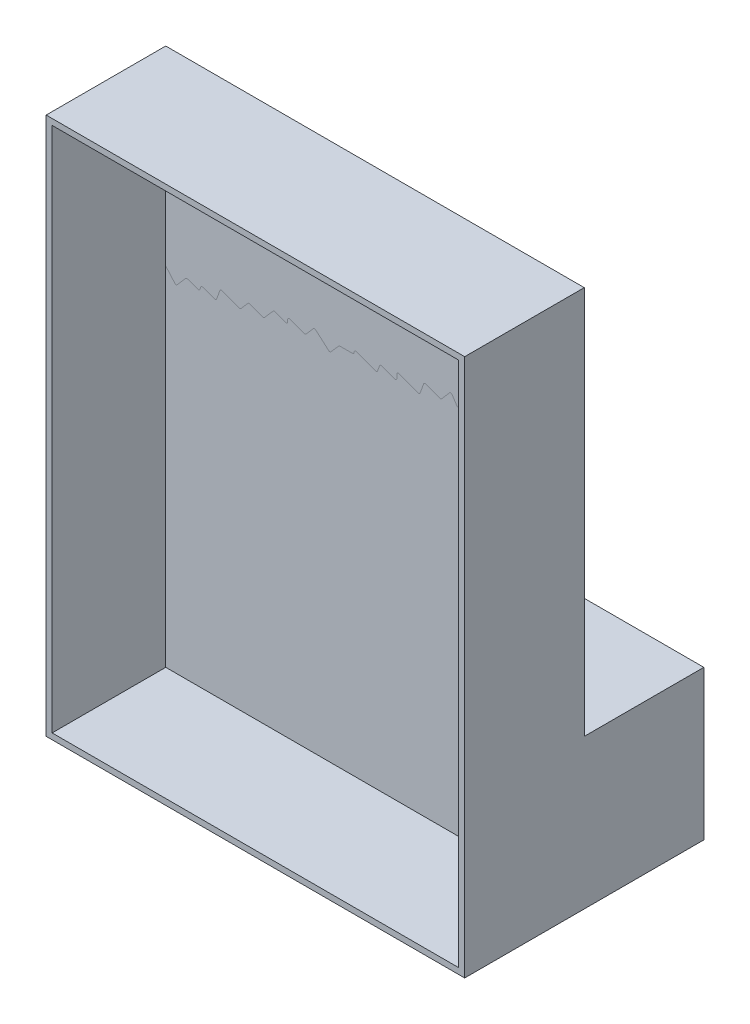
from build123d import *

# Parameters (mm, degrees)
ESQUISSE1_W             = 1400
ESQUISSE1_H             = 1800
BOSS_EXTRU_1_DEPTH      = 200
COQUE1_T                = -20
ESQUISSE2_W             = 1400
ESQUISSE2_H             = 500
BOSS_EXTRU_2_DEPTH      = 400
ESQUISSE3_W             = 270
ESQUISSE3_H             = 300
ENL_V_MAT_EXTRU_1_DEPTH = 400
ENL_V_MAT_EXTRU_2_REACH = 1210.305
BOSS_EXTRU_3_DEPTH      = 20


with BuildPart() as part:
    # Esquisse1 → Boss.-Extru.1 (new, symmetric)
    with BuildSketch(Plane.XY):
        Rectangle(ESQUISSE1_W, ESQUISSE1_H)
    extrude(amount=BOSS_EXTRU_1_DEPTH, both=True)

    # Coque1
    coque1_openings = [part.faces().sort_by_distance(p)[0] for p in [
        (0, 0, 200),
    ]]
    offset(amount=COQUE1_T, openings=coque1_openings, kind=Kind.INTERSECTION)

    # Esquisse2 → Boss.-Extru.2 (add)
    with BuildSketch(Plane(origin=(0, 0, -200), x_dir=(-1, 0, 0), z_dir=(0, 0, -1))):
        with Locations((0, -650)):
            Rectangle(ESQUISSE2_W, ESQUISSE2_H)
    extrude(amount=BOSS_EXTRU_2_DEPTH)

    # Esquisse3 → Enl_v. mat.-Extru.1 (cut)
    with BuildSketch(Plane(origin=(0, 0, -600), x_dir=(-1, 0, 0), z_dir=(0, 0, -1))):
        with Locations((-501, -650)):
            Rectangle(ESQUISSE3_W, ESQUISSE3_H)
        with Locations((-167, -650)):
            Rectangle(ESQUISSE3_W, ESQUISSE3_H)
        with Locations((167, -650)):
            Rectangle(ESQUISSE3_W, ESQUISSE3_H)
        with Locations((501, -650)):
            Rectangle(ESQUISSE3_W, ESQUISSE3_H)
    extrude(amount=-ENL_V_MAT_EXTRU_1_DEPTH, mode=Mode.SUBTRACT)

    # Esquisse4 → Enl_v. mat.-Extru.2 (cut, up to next)
    with BuildSketch(Plane(origin=(0, 0, -200), x_dir=(-1, 0, 0), z_dir=(0, 0, -1)), mode=Mode.PRIVATE) as enl_v_mat_extru_2_sk1:
        with BuildLine():
            Line((-680, 745.327259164), (-680, 426.37321948))
            Line((-680, 426.37321948), (-630.01055563, 426.37321948))
            ThreePointArc((-630.01055563, 426.37321948), (-628.585727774, 426.165908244), (-627.279053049, 425.561165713))
            Line((-627.279053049, 425.561165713), (-585.066427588, 398.028841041))
            ThreePointArc((-585.066427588, 398.028841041), (-581.982993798, 397.22918821), (-579.042401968, 398.453903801))
            Line((-579.042401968, 398.453903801), (-546.48647738, 426.940337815))
            ThreePointArc((-546.48647738, 426.940337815), (-542.861359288, 428.166380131), (-539.431070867, 426.469977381))
            Line((-539.431070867, 426.469977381), (-515.020264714, 398.571913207))
            ThreePointArc((-515.020264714, 398.571913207), (-513.323462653, 397.311271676), (-511.257381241, 396.864436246))
            Line((-511.257381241, 396.864436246), (-463.83513223, 396.864436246))
            ThreePointArc((-463.83513223, 396.864436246), (-461.769050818, 396.417600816), (-460.072248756, 395.156959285))
            Line((-460.072248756, 395.156959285), (-435.265251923, 366.806105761))
            ThreePointArc((-435.265251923, 366.806105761), (-431.834963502, 365.109703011), (-428.20984541, 366.335745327))
            Line((-428.20984541, 366.335745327), (-377.347209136, 410.840552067))
            ThreePointArc((-377.347209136, 410.840552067), (-372.802144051, 411.918240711), (-369.350249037, 408.771265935))
            Line((-369.350249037, 408.771265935), (-354.078458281, 366.349624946))
            ThreePointArc((-354.078458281, 366.349624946), (-352.249087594, 363.952501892), (-349.374021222, 363.043222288))
            Line((-349.374021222, 363.043222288), (-297.493125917, 363.043222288))
            ThreePointArc((-297.493125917, 363.043222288), (-295.111688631, 363.646774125), (-293.305179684, 365.311719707))
            Line((-293.305179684, 365.311719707), (-277.53770531, 389.486448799))
            ThreePointArc((-277.53770531, 389.486448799), (-273.701690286, 391.742545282), (-269.586875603, 390.047469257))
            Line((-269.586875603, 390.047469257), (-242.847964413, 359.48871361))
            ThreePointArc((-242.847964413, 359.48871361), (-240.337622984, 357.940664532), (-237.391483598, 358.07679959))
            Line((-237.391483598, 358.07679959), (-189.040093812, 375.483299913))
            ThreePointArc((-189.040093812, 375.483299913), (-185.217511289, 375.302956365), (-182.642059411, 372.472460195))
            Line((-182.642059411, 372.472460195), (-171.123934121, 340.477667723))
            ThreePointArc((-171.123934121, 340.477667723), (-168.548482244, 337.647171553), (-164.725899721, 337.466828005))
            Line((-164.725899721, 337.466828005), (-99.748076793, 360.858844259))
            ThreePointArc((-99.748076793, 360.858844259), (-95.179413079, 360.245127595), (-93.054479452, 356.154407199))
            Line((-93.054479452, 356.154407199), (-93.054479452, 342.887362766))
            ThreePointArc((-93.054479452, 342.887362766), (-90.929545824, 338.79664237), (-86.36088211, 338.182925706))
            Line((-86.36088211, 338.182925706), (-41.576625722, 354.305258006))
            ThreePointArc((-41.576625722, 354.305258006), (-37.754043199, 354.124914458), (-35.178591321, 351.294418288))
            Line((-35.178591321, 351.294418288), (-28.506322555, 332.760338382))
            ThreePointArc((-28.506322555, 332.760338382), (-25.930870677, 329.929842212), (-22.108288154, 329.749498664))
            Line((-22.108288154, 329.749498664), (43.117230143, 353.230685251))
            ThreePointArc((43.117230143, 353.230685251), (47.685893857, 352.616968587), (49.810827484, 348.526248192))
            Line((49.810827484, 348.526248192), (49.810827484, 346.848140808))
            ThreePointArc((49.810827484, 346.848140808), (51.275293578, 343.312606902), (54.810827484, 341.848140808))
            Line((54.810827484, 341.848140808), (97.570805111, 341.848140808))
            ThreePointArc((97.570805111, 341.848140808), (99.636886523, 341.401305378), (101.333688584, 340.140663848))
            Line((101.333688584, 340.140663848), (127.401577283, 310.348791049))
            ThreePointArc((127.401577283, 310.348791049), (130.831865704, 308.652388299), (134.456983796, 309.878430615))
            Line((134.456983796, 309.878430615), (178.898427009, 348.764693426))
            ThreePointArc((178.898427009, 348.764693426), (182.523545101, 349.990735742), (185.953833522, 348.294332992))
            Line((185.953833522, 348.294332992), (210.568125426, 320.163713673))
            ThreePointArc((210.568125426, 320.163713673), (213.078466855, 318.615664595), (216.024606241, 318.751799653))
            Line((216.024606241, 318.751799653), (265.430491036, 336.537918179))
            ThreePointArc((265.430491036, 336.537918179), (269.99915475, 335.924201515), (272.124088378, 331.83348112))
            Line((272.124088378, 331.83348112), (272.124088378, 324.710357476))
            ThreePointArc((272.124088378, 324.710357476), (274.249022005, 320.61963708), (278.817685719, 320.005920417))
            Line((278.817685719, 320.005920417), (315.224227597, 333.112275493))
            ThreePointArc((315.224227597, 333.112275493), (318.170366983, 333.248410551), (320.680708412, 331.700361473))
            Line((320.680708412, 331.700361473), (349.540055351, 298.718250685))
            ThreePointArc((349.540055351, 298.718250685), (352.05039678, 297.170201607), (354.996536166, 297.306336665))
            Line((354.996536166, 297.306336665), (399.594376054, 313.361559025))
            ThreePointArc((399.594376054, 313.361559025), (402.540515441, 313.497694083), (405.050856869, 311.949645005))
            Line((405.050856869, 311.949645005), (428.235335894, 285.453097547))
            ThreePointArc((428.235335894, 285.453097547), (430.745677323, 283.905048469), (433.691816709, 284.041183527))
            Line((433.691816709, 284.041183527), (492.503644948, 305.213441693))
            ThreePointArc((492.503644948, 305.213441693), (496.326227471, 305.033098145), (498.901679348, 302.202601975))
            Line((498.901679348, 302.202601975), (509.827467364, 271.85319082))
            ThreePointArc((509.827467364, 271.85319082), (512.402919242, 269.02269465), (516.225501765, 268.842351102))
            Line((516.225501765, 268.842351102), (556.454621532, 283.324834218))
            ThreePointArc((556.454621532, 283.324834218), (560.277204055, 283.144490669), (562.852655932, 280.3139945))
            Line((562.852655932, 280.3139945), (565.898545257, 271.85319082))
            ThreePointArc((565.898545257, 271.85319082), (568.473997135, 269.02269465), (572.296579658, 268.842351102))
            Line((572.296579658, 268.842351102), (607.694597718, 281.585637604))
            ThreePointArc((607.694597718, 281.585637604), (610.640737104, 281.721772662), (613.151078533, 280.173723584))
            Line((613.151078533, 280.173723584), (641.688930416, 247.559035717))
            ThreePointArc((641.688930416, 247.559035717), (645.4521097, 245.851558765), (649.215086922, 247.559480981))
            Line((649.215086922, 247.559480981), (680, 282.750640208))
            Line((680, 282.750640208), (680, 512.173721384))
            Line((680, 512.173721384), (613.762081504, 523.796983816))
            ThreePointArc((613.762081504, 523.796983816), (611.407184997, 524.89583432), (609.921827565, 527.02813901))
            Line((609.921827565, 527.02813901), (606.89078242, 535.447708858))
            ThreePointArc((606.89078242, 535.447708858), (604.315330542, 538.278205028), (600.492748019, 538.458548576))
            Line((600.492748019, 538.458548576), (562.845127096, 524.905405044))
            ThreePointArc((562.845127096, 524.905405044), (561.15861715, 524.609847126), (559.471276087, 524.900622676))
            Line((559.471276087, 524.900622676), (520.045828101, 538.967657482))
            ThreePointArc((520.045828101, 538.967657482), (517.639440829, 540.796014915), (516.726081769, 543.676876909))
            Line((516.726081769, 543.676876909), (516.726081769, 554.175823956))
            ThreePointArc((516.726081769, 554.175823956), (515.261615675, 557.711357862), (511.726081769, 559.175823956))
            Line((511.726081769, 559.175823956), (450.187606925, 559.175823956))
            ThreePointArc((450.187606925, 559.175823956), (448.121525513, 559.622659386), (446.424723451, 560.883300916))
            Line((446.424723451, 560.883300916), (432.728440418, 576.536195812))
            ThreePointArc((432.728440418, 576.536195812), (430.218098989, 578.08424489), (427.271959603, 577.948109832))
            Line((427.271959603, 577.948109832), (378.336649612, 560.331398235))
            ThreePointArc((378.336649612, 560.331398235), (375.390510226, 560.195263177), (372.880168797, 561.743312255))
            Line((372.880168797, 561.743312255), (355.079130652, 582.087355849))
            ThreePointArc((355.079130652, 582.087355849), (351.648842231, 583.783758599), (348.023724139, 582.557716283))
            Line((348.023724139, 582.557716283), (322.197039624, 559.959367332))
            ThreePointArc((322.197039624, 559.959367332), (318.571921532, 558.733325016), (315.141633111, 560.429727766))
            Line((315.141633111, 560.429727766), (294.39272784, 584.142762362))
            ThreePointArc((294.39272784, 584.142762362), (292.695925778, 585.403403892), (290.629844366, 585.850239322))
            Line((290.629844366, 585.850239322), (253.618332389, 585.850239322))
            ThreePointArc((253.618332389, 585.850239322), (251.552250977, 586.297074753), (249.855448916, 587.557716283))
            Line((249.855448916, 587.557716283), (216.341424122, 625.859458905))
            ThreePointArc((216.341424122, 625.859458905), (212.226609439, 627.554534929), (208.390594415, 625.298438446))
            Line((208.390594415, 625.298438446), (186.266493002, 591.377713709))
            ThreePointArc((186.266493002, 591.377713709), (182.430477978, 589.121617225), (178.315663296, 590.81669325))
            Line((178.315663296, 590.81669325), (145.554148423, 628.258424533))
            ThreePointArc((145.554148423, 628.258424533), (143.043806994, 629.806473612), (140.097667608, 629.670338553))
            Line((140.097667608, 629.670338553), (89.157543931, 611.33189403))
            ThreePointArc((89.157543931, 611.33189403), (86.211404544, 611.195758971), (83.701063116, 612.74380805))
            Line((83.701063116, 612.74380805), (52.057379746, 648.908017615))
            ThreePointArc((52.057379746, 648.908017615), (49.547038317, 650.456066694), (46.600898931, 650.319931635))
            Line((46.600898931, 650.319931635), (-23.60279666, 625.046601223))
            ThreePointArc((-23.60279666, 625.046601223), (-26.548936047, 624.910466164), (-29.059277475, 626.458515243))
            Line((-29.059277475, 626.458515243), (-44.68509985, 644.316597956))
            ThreePointArc((-44.68509985, 644.316597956), (-47.195441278, 645.864647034), (-50.141580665, 645.728511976))
            Line((-50.141580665, 645.728511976), (-89.844550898, 631.435442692))
            ThreePointArc((-89.844550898, 631.435442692), (-92.790690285, 631.299307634), (-95.301031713, 632.847356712))
            Line((-95.301031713, 632.847356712), (-119.865308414, 660.920815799))
            ThreePointArc((-119.865308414, 660.920815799), (-122.375649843, 662.468864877), (-125.321789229, 662.332729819))
            Line((-125.321789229, 662.332729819), (-166.220408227, 647.609226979))
            ThreePointArc((-166.220408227, 647.609226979), (-169.166547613, 647.473091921), (-171.676889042, 649.021140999))
            Line((-171.676889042, 649.021140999), (-195.948453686, 676.760072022))
            ThreePointArc((-195.948453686, 676.760072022), (-199.378742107, 678.456474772), (-203.003860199, 677.230432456))
            Line((-203.003860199, 677.230432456), (-224.359656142, 658.544111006))
            ThreePointArc((-224.359656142, 658.544111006), (-227.984774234, 657.31806869), (-231.415062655, 659.01447144))
            Line((-231.415062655, 659.01447144), (-249.787761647, 680.011841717))
            ThreePointArc((-249.787761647, 680.011841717), (-253.218050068, 681.708244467), (-256.84316816, 680.482202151))
            Line((-256.84316816, 680.482202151), (-291.021877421, 650.575831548))
            ThreePointArc((-291.021877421, 650.575831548), (-294.646995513, 649.349789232), (-298.077283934, 651.046191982))
            Line((-298.077283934, 651.046191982), (-310.256148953, 664.964894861))
            ThreePointArc((-310.256148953, 664.964894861), (-312.766490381, 666.512943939), (-315.712629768, 666.376808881))
            Line((-315.712629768, 666.376808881), (-354.410389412, 652.445615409))
            ThreePointArc((-354.410389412, 652.445615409), (-357.356528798, 652.309480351), (-359.866870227, 653.857529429))
            Line((-359.866870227, 653.857529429), (-385.187464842, 682.795351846))
            ThreePointArc((-385.187464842, 682.795351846), (-386.138108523, 683.636992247), (-387.270094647, 684.212048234))
            Line((-387.270094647, 684.212048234), (-446.01203563, 705.171224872))
            ThreePointArc((-446.01203563, 705.171224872), (-448.627030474, 705.373854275), (-450.984812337, 704.224888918))
            Line((-450.984812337, 704.224888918), (-470.593544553, 687.06724823))
            ThreePointArc((-470.593544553, 687.06724823), (-474.218662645, 685.841205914), (-477.648951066, 687.537608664))
            Line((-477.648951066, 687.537608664), (-509.180575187, 723.573750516))
            ThreePointArc((-509.180575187, 723.573750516), (-513.29538987, 725.268826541), (-517.131404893, 723.012730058))
            Line((-517.131404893, 723.012730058), (-539.118411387, 689.302199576))
            ThreePointArc((-539.118411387, 689.302199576), (-542.95442641, 687.046103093), (-547.069241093, 688.741179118))
            Line((-547.069241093, 688.741179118), (-579.646835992, 725.972716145))
            ThreePointArc((-579.646835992, 725.972716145), (-582.15717742, 727.520765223), (-585.103316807, 727.384630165))
            Line((-585.103316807, 727.384630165), (-626.183035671, 712.595931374))
            ThreePointArc((-626.183035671, 712.595931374), (-628.456290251, 712.334082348), (-630.608135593, 713.1124222))
            Line((-630.608135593, 713.1124222), (-680, 745.327259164))
        make_face()
    enl_v_mat_extru_2_tool1 = extrude(enl_v_mat_extru_2_sk1.sketch, amount=-ENL_V_MAT_EXTRU_2_REACH, mode=Mode.PRIVATE) & part.part
    add(enl_v_mat_extru_2_tool1.solids().sort_by_distance((22.367634, 489.100637, -200))[0], mode=Mode.SUBTRACT)


with BuildPart() as body_2:
    # Esquisse4_2 → Boss.-Extru.3 (new body)
    with BuildSketch(Plane(origin=(0, 0, -200), x_dir=(-1, 0, 0), z_dir=(0, 0, -1))):
        with BuildLine():
            Line((-680, 745.327259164), (-680, 426.37321948))
            Line((-680, 426.37321948), (-630.01055563, 426.37321948))
            ThreePointArc((-630.01055563, 426.37321948), (-628.585727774, 426.165908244), (-627.279053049, 425.561165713))
            Line((-627.279053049, 425.561165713), (-585.066427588, 398.028841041))
            ThreePointArc((-585.066427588, 398.028841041), (-581.982993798, 397.22918821), (-579.042401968, 398.453903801))
            Line((-579.042401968, 398.453903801), (-546.48647738, 426.940337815))
            ThreePointArc((-546.48647738, 426.940337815), (-542.861359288, 428.166380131), (-539.431070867, 426.469977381))
            Line((-539.431070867, 426.469977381), (-515.020264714, 398.571913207))
            ThreePointArc((-515.020264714, 398.571913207), (-513.323462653, 397.311271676), (-511.257381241, 396.864436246))
            Line((-511.257381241, 396.864436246), (-463.83513223, 396.864436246))
            ThreePointArc((-463.83513223, 396.864436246), (-461.769050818, 396.417600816), (-460.072248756, 395.156959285))
            Line((-460.072248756, 395.156959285), (-435.265251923, 366.806105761))
            ThreePointArc((-435.265251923, 366.806105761), (-431.834963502, 365.109703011), (-428.20984541, 366.335745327))
            Line((-428.20984541, 366.335745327), (-377.347209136, 410.840552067))
            ThreePointArc((-377.347209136, 410.840552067), (-372.802144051, 411.918240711), (-369.350249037, 408.771265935))
            Line((-369.350249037, 408.771265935), (-354.078458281, 366.349624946))
            ThreePointArc((-354.078458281, 366.349624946), (-352.249087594, 363.952501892), (-349.374021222, 363.043222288))
            Line((-349.374021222, 363.043222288), (-297.493125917, 363.043222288))
            ThreePointArc((-297.493125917, 363.043222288), (-295.111688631, 363.646774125), (-293.305179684, 365.311719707))
            Line((-293.305179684, 365.311719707), (-277.53770531, 389.486448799))
            ThreePointArc((-277.53770531, 389.486448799), (-273.701690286, 391.742545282), (-269.586875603, 390.047469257))
            Line((-269.586875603, 390.047469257), (-242.847964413, 359.48871361))
            ThreePointArc((-242.847964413, 359.48871361), (-240.337622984, 357.940664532), (-237.391483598, 358.07679959))
            Line((-237.391483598, 358.07679959), (-189.040093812, 375.483299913))
            ThreePointArc((-189.040093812, 375.483299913), (-185.217511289, 375.302956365), (-182.642059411, 372.472460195))
            Line((-182.642059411, 372.472460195), (-171.123934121, 340.477667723))
            ThreePointArc((-171.123934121, 340.477667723), (-168.548482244, 337.647171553), (-164.725899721, 337.466828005))
            Line((-164.725899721, 337.466828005), (-99.748076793, 360.858844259))
            ThreePointArc((-99.748076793, 360.858844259), (-95.179413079, 360.245127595), (-93.054479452, 356.154407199))
            Line((-93.054479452, 356.154407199), (-93.054479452, 342.887362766))
            ThreePointArc((-93.054479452, 342.887362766), (-90.929545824, 338.79664237), (-86.36088211, 338.182925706))
            Line((-86.36088211, 338.182925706), (-41.576625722, 354.305258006))
            ThreePointArc((-41.576625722, 354.305258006), (-37.754043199, 354.124914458), (-35.178591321, 351.294418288))
            Line((-35.178591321, 351.294418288), (-28.506322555, 332.760338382))
            ThreePointArc((-28.506322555, 332.760338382), (-25.930870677, 329.929842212), (-22.108288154, 329.749498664))
            Line((-22.108288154, 329.749498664), (43.117230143, 353.230685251))
            ThreePointArc((43.117230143, 353.230685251), (47.685893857, 352.616968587), (49.810827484, 348.526248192))
            Line((49.810827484, 348.526248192), (49.810827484, 346.848140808))
            ThreePointArc((49.810827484, 346.848140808), (51.275293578, 343.312606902), (54.810827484, 341.848140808))
            Line((54.810827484, 341.848140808), (97.570805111, 341.848140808))
            ThreePointArc((97.570805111, 341.848140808), (99.636886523, 341.401305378), (101.333688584, 340.140663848))
            Line((101.333688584, 340.140663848), (127.401577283, 310.348791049))
            ThreePointArc((127.401577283, 310.348791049), (130.831865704, 308.652388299), (134.456983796, 309.878430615))
            Line((134.456983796, 309.878430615), (178.898427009, 348.764693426))
            ThreePointArc((178.898427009, 348.764693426), (182.523545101, 349.990735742), (185.953833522, 348.294332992))
            Line((185.953833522, 348.294332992), (210.568125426, 320.163713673))
            ThreePointArc((210.568125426, 320.163713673), (213.078466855, 318.615664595), (216.024606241, 318.751799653))
            Line((216.024606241, 318.751799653), (265.430491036, 336.537918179))
            ThreePointArc((265.430491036, 336.537918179), (269.99915475, 335.924201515), (272.124088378, 331.83348112))
            Line((272.124088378, 331.83348112), (272.124088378, 324.710357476))
            ThreePointArc((272.124088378, 324.710357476), (274.249022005, 320.61963708), (278.817685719, 320.005920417))
            Line((278.817685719, 320.005920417), (315.224227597, 333.112275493))
            ThreePointArc((315.224227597, 333.112275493), (318.170366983, 333.248410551), (320.680708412, 331.700361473))
            Line((320.680708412, 331.700361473), (349.540055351, 298.718250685))
            ThreePointArc((349.540055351, 298.718250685), (352.05039678, 297.170201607), (354.996536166, 297.306336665))
            Line((354.996536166, 297.306336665), (399.594376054, 313.361559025))
            ThreePointArc((399.594376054, 313.361559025), (402.540515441, 313.497694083), (405.050856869, 311.949645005))
            Line((405.050856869, 311.949645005), (428.235335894, 285.453097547))
            ThreePointArc((428.235335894, 285.453097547), (430.745677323, 283.905048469), (433.691816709, 284.041183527))
            Line((433.691816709, 284.041183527), (492.503644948, 305.213441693))
            ThreePointArc((492.503644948, 305.213441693), (496.326227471, 305.033098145), (498.901679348, 302.202601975))
            Line((498.901679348, 302.202601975), (509.827467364, 271.85319082))
            ThreePointArc((509.827467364, 271.85319082), (512.402919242, 269.02269465), (516.225501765, 268.842351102))
            Line((516.225501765, 268.842351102), (556.454621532, 283.324834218))
            ThreePointArc((556.454621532, 283.324834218), (560.277204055, 283.144490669), (562.852655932, 280.3139945))
            Line((562.852655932, 280.3139945), (565.898545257, 271.85319082))
            ThreePointArc((565.898545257, 271.85319082), (568.473997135, 269.02269465), (572.296579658, 268.842351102))
            Line((572.296579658, 268.842351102), (607.694597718, 281.585637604))
            ThreePointArc((607.694597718, 281.585637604), (610.640737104, 281.721772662), (613.151078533, 280.173723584))
            Line((613.151078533, 280.173723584), (641.688930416, 247.559035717))
            ThreePointArc((641.688930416, 247.559035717), (645.4521097, 245.851558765), (649.215086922, 247.559480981))
            Line((649.215086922, 247.559480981), (680, 282.750640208))
            Line((680, 282.750640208), (680, 512.173721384))
            Line((680, 512.173721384), (613.762081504, 523.796983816))
            ThreePointArc((613.762081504, 523.796983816), (611.407184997, 524.89583432), (609.921827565, 527.02813901))
            Line((609.921827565, 527.02813901), (606.89078242, 535.447708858))
            ThreePointArc((606.89078242, 535.447708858), (604.315330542, 538.278205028), (600.492748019, 538.458548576))
            Line((600.492748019, 538.458548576), (562.845127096, 524.905405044))
            ThreePointArc((562.845127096, 524.905405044), (561.15861715, 524.609847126), (559.471276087, 524.900622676))
            Line((559.471276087, 524.900622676), (520.045828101, 538.967657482))
            ThreePointArc((520.045828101, 538.967657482), (517.639440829, 540.796014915), (516.726081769, 543.676876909))
            Line((516.726081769, 543.676876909), (516.726081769, 554.175823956))
            ThreePointArc((516.726081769, 554.175823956), (515.261615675, 557.711357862), (511.726081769, 559.175823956))
            Line((511.726081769, 559.175823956), (450.187606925, 559.175823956))
            ThreePointArc((450.187606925, 559.175823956), (448.121525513, 559.622659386), (446.424723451, 560.883300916))
            Line((446.424723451, 560.883300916), (432.728440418, 576.536195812))
            ThreePointArc((432.728440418, 576.536195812), (430.218098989, 578.08424489), (427.271959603, 577.948109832))
            Line((427.271959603, 577.948109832), (378.336649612, 560.331398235))
            ThreePointArc((378.336649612, 560.331398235), (375.390510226, 560.195263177), (372.880168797, 561.743312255))
            Line((372.880168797, 561.743312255), (355.079130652, 582.087355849))
            ThreePointArc((355.079130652, 582.087355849), (351.648842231, 583.783758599), (348.023724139, 582.557716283))
            Line((348.023724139, 582.557716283), (322.197039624, 559.959367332))
            ThreePointArc((322.197039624, 559.959367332), (318.571921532, 558.733325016), (315.141633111, 560.429727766))
            Line((315.141633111, 560.429727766), (294.39272784, 584.142762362))
            ThreePointArc((294.39272784, 584.142762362), (292.695925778, 585.403403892), (290.629844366, 585.850239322))
            Line((290.629844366, 585.850239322), (253.618332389, 585.850239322))
            ThreePointArc((253.618332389, 585.850239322), (251.552250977, 586.297074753), (249.855448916, 587.557716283))
            Line((249.855448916, 587.557716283), (216.341424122, 625.859458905))
            ThreePointArc((216.341424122, 625.859458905), (212.226609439, 627.554534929), (208.390594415, 625.298438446))
            Line((208.390594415, 625.298438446), (186.266493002, 591.377713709))
            ThreePointArc((186.266493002, 591.377713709), (182.430477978, 589.121617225), (178.315663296, 590.81669325))
            Line((178.315663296, 590.81669325), (145.554148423, 628.258424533))
            ThreePointArc((145.554148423, 628.258424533), (143.043806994, 629.806473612), (140.097667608, 629.670338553))
            Line((140.097667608, 629.670338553), (89.157543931, 611.33189403))
            ThreePointArc((89.157543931, 611.33189403), (86.211404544, 611.195758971), (83.701063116, 612.74380805))
            Line((83.701063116, 612.74380805), (52.057379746, 648.908017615))
            ThreePointArc((52.057379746, 648.908017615), (49.547038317, 650.456066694), (46.600898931, 650.319931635))
            Line((46.600898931, 650.319931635), (-23.60279666, 625.046601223))
            ThreePointArc((-23.60279666, 625.046601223), (-26.548936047, 624.910466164), (-29.059277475, 626.458515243))
            Line((-29.059277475, 626.458515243), (-44.68509985, 644.316597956))
            ThreePointArc((-44.68509985, 644.316597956), (-47.195441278, 645.864647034), (-50.141580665, 645.728511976))
            Line((-50.141580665, 645.728511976), (-89.844550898, 631.435442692))
            ThreePointArc((-89.844550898, 631.435442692), (-92.790690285, 631.299307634), (-95.301031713, 632.847356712))
            Line((-95.301031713, 632.847356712), (-119.865308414, 660.920815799))
            ThreePointArc((-119.865308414, 660.920815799), (-122.375649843, 662.468864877), (-125.321789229, 662.332729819))
            Line((-125.321789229, 662.332729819), (-166.220408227, 647.609226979))
            ThreePointArc((-166.220408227, 647.609226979), (-169.166547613, 647.473091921), (-171.676889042, 649.021140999))
            Line((-171.676889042, 649.021140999), (-195.948453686, 676.760072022))
            ThreePointArc((-195.948453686, 676.760072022), (-199.378742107, 678.456474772), (-203.003860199, 677.230432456))
            Line((-203.003860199, 677.230432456), (-224.359656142, 658.544111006))
            ThreePointArc((-224.359656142, 658.544111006), (-227.984774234, 657.31806869), (-231.415062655, 659.01447144))
            Line((-231.415062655, 659.01447144), (-249.787761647, 680.011841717))
            ThreePointArc((-249.787761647, 680.011841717), (-253.218050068, 681.708244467), (-256.84316816, 680.482202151))
            Line((-256.84316816, 680.482202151), (-291.021877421, 650.575831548))
            ThreePointArc((-291.021877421, 650.575831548), (-294.646995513, 649.349789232), (-298.077283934, 651.046191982))
            Line((-298.077283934, 651.046191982), (-310.256148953, 664.964894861))
            ThreePointArc((-310.256148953, 664.964894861), (-312.766490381, 666.512943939), (-315.712629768, 666.376808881))
            Line((-315.712629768, 666.376808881), (-354.410389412, 652.445615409))
            ThreePointArc((-354.410389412, 652.445615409), (-357.356528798, 652.309480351), (-359.866870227, 653.857529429))
            Line((-359.866870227, 653.857529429), (-385.187464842, 682.795351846))
            ThreePointArc((-385.187464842, 682.795351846), (-386.138108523, 683.636992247), (-387.270094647, 684.212048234))
            Line((-387.270094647, 684.212048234), (-446.01203563, 705.171224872))
            ThreePointArc((-446.01203563, 705.171224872), (-448.627030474, 705.373854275), (-450.984812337, 704.224888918))
            Line((-450.984812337, 704.224888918), (-470.593544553, 687.06724823))
            ThreePointArc((-470.593544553, 687.06724823), (-474.218662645, 685.841205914), (-477.648951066, 687.537608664))
            Line((-477.648951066, 687.537608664), (-509.180575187, 723.573750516))
            ThreePointArc((-509.180575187, 723.573750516), (-513.29538987, 725.268826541), (-517.131404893, 723.012730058))
            Line((-517.131404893, 723.012730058), (-539.118411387, 689.302199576))
            ThreePointArc((-539.118411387, 689.302199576), (-542.95442641, 687.046103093), (-547.069241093, 688.741179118))
            Line((-547.069241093, 688.741179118), (-579.646835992, 725.972716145))
            ThreePointArc((-579.646835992, 725.972716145), (-582.15717742, 727.520765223), (-585.103316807, 727.384630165))
            Line((-585.103316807, 727.384630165), (-626.183035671, 712.595931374))
            ThreePointArc((-626.183035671, 712.595931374), (-628.456290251, 712.334082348), (-630.608135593, 713.1124222))
            Line((-630.608135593, 713.1124222), (-680, 745.327259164))
        make_face()
    extrude(amount=-BOSS_EXTRU_3_DEPTH)


solid = Compound([part.part, body_2.part])
